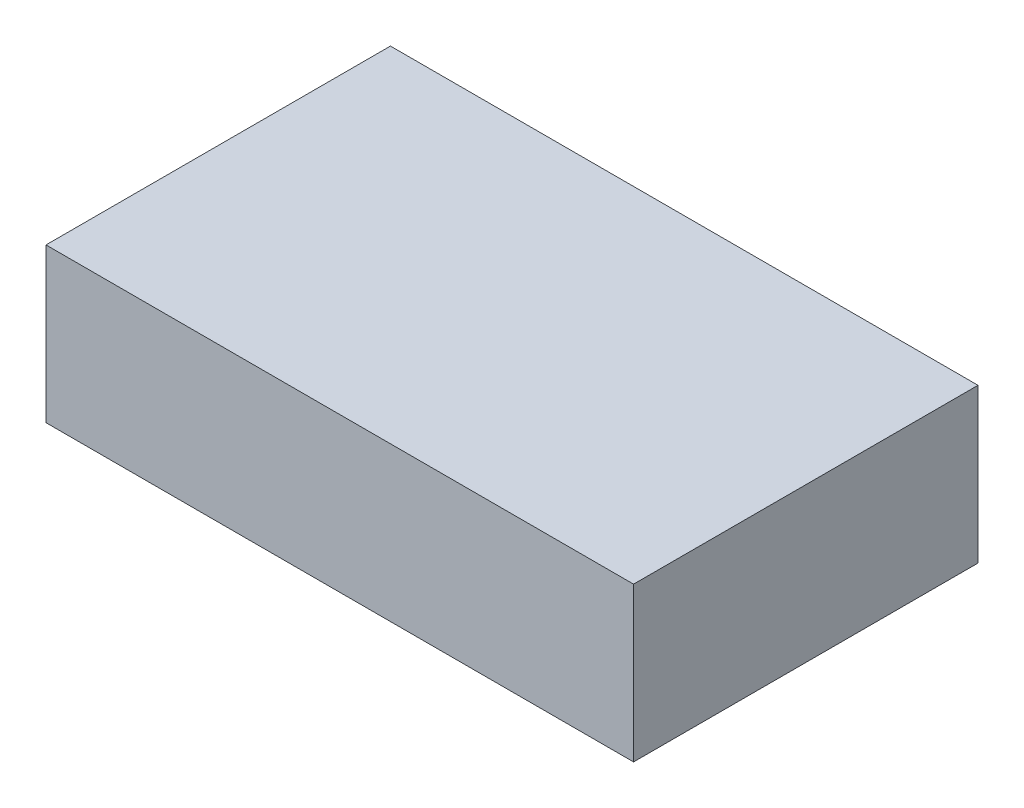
ISO-10303-21;
HEADER;
FILE_DESCRIPTION(('STEP AP214'),'2;1');
FILE_NAME('part.step','',(''),(''),'','','');
FILE_SCHEMA(('AUTOMOTIVE_DESIGN { 1 0 10303 214 1 1 1 1 }'));
ENDSEC;
DATA;
#1=APPLICATION_CONTEXT('core data for automotive mechanical design processes');
#2=APPLICATION_PROTOCOL_DEFINITION('international standard','automotive_design',2000,#1);
#3=PRODUCT_CONTEXT('',#1,'mechanical');
#4=PRODUCT('Part','Part','',(#3));
#5=PRODUCT_RELATED_PRODUCT_CATEGORY('part','',(#4));
#6=PRODUCT_DEFINITION_FORMATION('','',#4);
#7=PRODUCT_DEFINITION_CONTEXT('part definition',#1,'design');
#8=PRODUCT_DEFINITION('design','',#6,#7);
#9=PRODUCT_DEFINITION_SHAPE('','',#8);
#10=(LENGTH_UNIT() NAMED_UNIT(*) SI_UNIT(.MILLI.,.METRE.));
#11=(NAMED_UNIT(*) PLANE_ANGLE_UNIT() SI_UNIT($,.RADIAN.));
#12=(NAMED_UNIT(*) SI_UNIT($,.STERADIAN.) SOLID_ANGLE_UNIT());
#13=UNCERTAINTY_MEASURE_WITH_UNIT(LENGTH_MEASURE(1.E-05),#10,'distance_accuracy_value','');
#14=(GEOMETRIC_REPRESENTATION_CONTEXT(3) GLOBAL_UNCERTAINTY_ASSIGNED_CONTEXT((#13)) GLOBAL_UNIT_ASSIGNED_CONTEXT((#10,
#11,#12)) REPRESENTATION_CONTEXT('',''));
#15=CARTESIAN_POINT('',(0.,0.,0.));
#16=DIRECTION('',(0.,0.,1.));
#17=DIRECTION('',(1.,0.,0.));
#18=AXIS2_PLACEMENT_3D('',#15,#16,#17);
#19=CARTESIAN_POINT('',(67.619013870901,17.8957186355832,30.4091027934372));
#20=DIRECTION('',(0.,0.,1.));
#21=DIRECTION('',(1.,0.,0.));
#22=AXIS2_PLACEMENT_3D('',#19,#20,#21);
#23=PLANE('',#22);
#24=DIRECTION('',(0.,1.,0.));
#25=VECTOR('',#24,1.);
#26=CARTESIAN_POINT('',(69.619013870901,42.8957186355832,30.4091027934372));
#27=LINE('',#26,#25);
#28=CARTESIAN_POINT('',(69.619013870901,24.8957186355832,30.4091027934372));
#29=VERTEX_POINT('',#28);
#30=CARTESIAN_POINT('',(69.619013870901,37.8957186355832,30.4091027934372));
#31=VERTEX_POINT('',#30);
#32=EDGE_CURVE('E457',#29,#31,#27,.T.);
#33=ORIENTED_EDGE('',*,*,#32,.F.);
#34=DIRECTION('',(1.,0.,0.));
#35=VECTOR('',#34,1.);
#36=CARTESIAN_POINT('',(67.619013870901,24.8957186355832,30.4091027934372));
#37=LINE('',#36,#35);
#38=CARTESIAN_POINT('',(72.5,24.8957186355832,30.4091027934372));
#39=VERTEX_POINT('',#38);
#40=EDGE_CURVE('E590',#29,#39,#37,.T.);
#41=ORIENTED_EDGE('',*,*,#40,.T.);
#42=DIRECTION('',(0.,1.,0.));
#43=VECTOR('',#42,1.);
#44=CARTESIAN_POINT('',(72.5,38.,30.4091027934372));
#45=LINE('',#44,#43);
#46=CARTESIAN_POINT('',(72.5,37.8957186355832,30.4091027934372));
#47=VERTEX_POINT('',#46);
#48=EDGE_CURVE('E305',#39,#47,#45,.T.);
#49=ORIENTED_EDGE('',*,*,#48,.T.);
#50=DIRECTION('',(-1.,0.,0.));
#51=VECTOR('',#50,1.);
#52=CARTESIAN_POINT('',(67.619013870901,37.8957186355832,30.4091027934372));
#53=LINE('',#52,#51);
#54=EDGE_CURVE('E414',#47,#31,#53,.T.);
#55=ORIENTED_EDGE('',*,*,#54,.T.);
#56=EDGE_LOOP('',(#33,#41,#49,#55));
#57=FACE_BOUND('',#56,.T.);
#58=ADVANCED_FACE('F43',(#57),#23,.T.);
#59=CARTESIAN_POINT('',(72.619013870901,17.8957186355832,-29.5908972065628));
#60=DIRECTION('',(0.,0.,-1.));
#61=DIRECTION('',(-1.,0.,0.));
#62=AXIS2_PLACEMENT_3D('',#59,#60,#61);
#63=PLANE('',#62);
#64=DIRECTION('',(0.,-1.,0.));
#65=VECTOR('',#64,1.);
#66=CARTESIAN_POINT('',(72.5,38.,-29.5908972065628));
#67=LINE('',#66,#65);
#68=CARTESIAN_POINT('',(72.5,37.8957186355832,-29.5908972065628));
#69=VERTEX_POINT('',#68);
#70=CARTESIAN_POINT('',(72.5,24.8957186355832,-29.5908972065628));
#71=VERTEX_POINT('',#70);
#72=EDGE_CURVE('E302',#69,#71,#67,.T.);
#73=ORIENTED_EDGE('',*,*,#72,.T.);
#74=DIRECTION('',(-1.,0.,0.));
#75=VECTOR('',#74,1.);
#76=CARTESIAN_POINT('',(72.619013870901,24.8957186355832,-29.5908972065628));
#77=LINE('',#76,#75);
#78=CARTESIAN_POINT('',(69.619013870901,24.8957186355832,-29.5908972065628));
#79=VERTEX_POINT('',#78);
#80=EDGE_CURVE('E285',#71,#79,#77,.T.);
#81=ORIENTED_EDGE('',*,*,#80,.T.);
#82=DIRECTION('',(0.,1.,0.));
#83=VECTOR('',#82,1.);
#84=CARTESIAN_POINT('',(69.619013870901,17.8957186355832,-29.5908972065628));
#85=LINE('',#84,#83);
#86=CARTESIAN_POINT('',(69.619013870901,37.8957186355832,-29.5908972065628));
#87=VERTEX_POINT('',#86);
#88=EDGE_CURVE('E464',#87,#79,#85,.F.);
#89=ORIENTED_EDGE('',*,*,#88,.F.);
#90=DIRECTION('',(1.,0.,0.));
#91=VECTOR('',#90,1.);
#92=CARTESIAN_POINT('',(72.619013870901,37.8957186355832,-29.5908972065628));
#93=LINE('',#92,#91);
#94=EDGE_CURVE('E310',#87,#69,#93,.T.);
#95=ORIENTED_EDGE('',*,*,#94,.T.);
#96=EDGE_LOOP('',(#73,#81,#89,#95));
#97=FACE_BOUND('',#96,.T.);
#98=ADVANCED_FACE('F308',(#97),#63,.T.);
#99=CARTESIAN_POINT('',(67.619013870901,17.8957186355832,30.4091027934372));
#100=DIRECTION('',(-1.,0.,0.));
#101=DIRECTION('',(0.,0.,1.));
#102=AXIS2_PLACEMENT_3D('',#99,#100,#101);
#103=PLANE('',#102);
#104=DIRECTION('',(0.,1.,0.));
#105=VECTOR('',#104,1.);
#106=CARTESIAN_POINT('',(67.619013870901,17.8957186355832,22.4091027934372));
#107=LINE('',#106,#105);
#108=CARTESIAN_POINT('',(67.619013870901,24.8957186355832,22.4091027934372));
#109=VERTEX_POINT('',#108);
#110=CARTESIAN_POINT('',(67.619013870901,37.8957186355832,22.4091027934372));
#111=VERTEX_POINT('',#110);
#112=EDGE_CURVE('E452',#109,#111,#107,.T.);
#113=ORIENTED_EDGE('',*,*,#112,.F.);
#114=DIRECTION('',(0.,0.,1.));
#115=VECTOR('',#114,1.);
#116=CARTESIAN_POINT('',(67.619013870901,24.8957186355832,30.4091027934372));
#117=LINE('',#116,#115);
#118=CARTESIAN_POINT('',(67.619013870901,24.8957186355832,28.4091027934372));
#119=VERTEX_POINT('',#118);
#120=EDGE_CURVE('E596',#109,#119,#117,.T.);
#121=ORIENTED_EDGE('',*,*,#120,.T.);
#122=DIRECTION('',(0.,1.,0.));
#123=VECTOR('',#122,1.);
#124=CARTESIAN_POINT('',(67.619013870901,17.8957186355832,28.4091027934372));
#125=LINE('',#124,#123);
#126=CARTESIAN_POINT('',(67.619013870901,37.8957186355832,28.4091027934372));
#127=VERTEX_POINT('',#126);
#128=EDGE_CURVE('E459',#127,#119,#125,.F.);
#129=ORIENTED_EDGE('',*,*,#128,.F.);
#130=DIRECTION('',(0.,0.,-1.));
#131=VECTOR('',#130,1.);
#132=CARTESIAN_POINT('',(67.619013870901,37.8957186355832,30.4091027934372));
#133=LINE('',#132,#131);
#134=EDGE_CURVE('E409',#127,#111,#133,.T.);
#135=ORIENTED_EDGE('',*,*,#134,.T.);
#136=EDGE_LOOP('',(#113,#121,#129,#135));
#137=FACE_BOUND('',#136,.T.);
#138=ADVANCED_FACE('F628',(#137),#103,.T.);
#139=CARTESIAN_POINT('',(67.619013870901,17.8957186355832,20.4091027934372));
#140=DIRECTION('',(0.,0.,1.));
#141=DIRECTION('',(1.,0.,0.));
#142=AXIS2_PLACEMENT_3D('',#139,#140,#141);
#143=PLANE('',#142);
#144=DIRECTION('',(0.,1.,0.));
#145=VECTOR('',#144,1.);
#146=CARTESIAN_POINT('',(61.619013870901,17.8957186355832,20.4091027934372));
#147=LINE('',#146,#145);
#148=CARTESIAN_POINT('',(61.619013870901,24.8957186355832,20.4091027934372));
#149=VERTEX_POINT('',#148);
#150=CARTESIAN_POINT('',(61.619013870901,37.8957186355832,20.4091027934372));
#151=VERTEX_POINT('',#150);
#152=EDGE_CURVE('E437',#149,#151,#147,.T.);
#153=ORIENTED_EDGE('',*,*,#152,.F.);
#154=DIRECTION('',(1.,0.,0.));
#155=VECTOR('',#154,1.);
#156=CARTESIAN_POINT('',(67.619013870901,24.8957186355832,20.4091027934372));
#157=LINE('',#156,#155);
#158=CARTESIAN_POINT('',(65.619013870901,24.8957186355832,20.4091027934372));
#159=VERTEX_POINT('',#158);
#160=EDGE_CURVE('E1123',#149,#159,#157,.T.);
#161=ORIENTED_EDGE('',*,*,#160,.T.);
#162=DIRECTION('',(0.,1.,0.));
#163=VECTOR('',#162,1.);
#164=CARTESIAN_POINT('',(65.619013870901,17.8957186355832,20.4091027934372));
#165=LINE('',#164,#163);
#166=CARTESIAN_POINT('',(65.619013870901,37.8957186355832,20.4091027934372));
#167=VERTEX_POINT('',#166);
#168=EDGE_CURVE('E454',#167,#159,#165,.F.);
#169=ORIENTED_EDGE('',*,*,#168,.F.);
#170=DIRECTION('',(-1.,0.,0.));
#171=VECTOR('',#170,1.);
#172=CARTESIAN_POINT('',(67.619013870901,37.8957186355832,20.4091027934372));
#173=LINE('',#172,#171);
#174=EDGE_CURVE('E403',#167,#151,#173,.T.);
#175=ORIENTED_EDGE('',*,*,#174,.T.);
#176=EDGE_LOOP('',(#153,#161,#169,#175));
#177=FACE_BOUND('',#176,.T.);
#178=ADVANCED_FACE('F635',(#177),#143,.T.);
#179=CARTESIAN_POINT('',(59.619013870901,17.8957186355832,20.4091027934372));
#180=DIRECTION('',(1.,0.,0.));
#181=DIRECTION('',(0.,0.,-1.));
#182=AXIS2_PLACEMENT_3D('',#179,#180,#181);
#183=PLANE('',#182);
#184=DIRECTION('',(0.,1.,0.));
#185=VECTOR('',#184,1.);
#186=CARTESIAN_POINT('',(59.619013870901,42.8957186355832,25.4091027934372));
#187=LINE('',#186,#185);
#188=CARTESIAN_POINT('',(59.619013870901,24.8957186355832,25.4091027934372));
#189=VERTEX_POINT('',#188);
#190=CARTESIAN_POINT('',(59.619013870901,37.8957186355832,25.4091027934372));
#191=VERTEX_POINT('',#190);
#192=EDGE_CURVE('E432',#189,#191,#187,.T.);
#193=ORIENTED_EDGE('',*,*,#192,.F.);
#194=DIRECTION('',(0.,0.,-1.));
#195=VECTOR('',#194,1.);
#196=CARTESIAN_POINT('',(59.619013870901,24.8957186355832,20.4091027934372));
#197=LINE('',#196,#195);
#198=CARTESIAN_POINT('',(59.619013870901,24.8957186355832,22.4091027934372));
#199=VERTEX_POINT('',#198);
#200=EDGE_CURVE('E1130',#189,#199,#197,.T.);
#201=ORIENTED_EDGE('',*,*,#200,.T.);
#202=DIRECTION('',(0.,1.,0.));
#203=VECTOR('',#202,1.);
#204=CARTESIAN_POINT('',(59.619013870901,17.8957186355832,22.4091027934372));
#205=LINE('',#204,#203);
#206=CARTESIAN_POINT('',(59.619013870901,37.8957186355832,22.4091027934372));
#207=VERTEX_POINT('',#206);
#208=EDGE_CURVE('E439',#207,#199,#205,.F.);
#209=ORIENTED_EDGE('',*,*,#208,.F.);
#210=DIRECTION('',(0.,0.,1.));
#211=VECTOR('',#210,1.);
#212=CARTESIAN_POINT('',(59.619013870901,37.8957186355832,20.4091027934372));
#213=LINE('',#212,#211);
#214=EDGE_CURVE('E397',#207,#191,#213,.T.);
#215=ORIENTED_EDGE('',*,*,#214,.T.);
#216=EDGE_LOOP('',(#193,#201,#209,#215));
#217=FACE_BOUND('',#216,.T.);
#218=ADVANCED_FACE('F639',(#217),#183,.T.);
#219=CARTESIAN_POINT('',(59.619013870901,17.8957186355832,30.4091027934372));
#220=DIRECTION('',(0.,0.,1.));
#221=DIRECTION('',(1.,0.,0.));
#222=AXIS2_PLACEMENT_3D('',#219,#220,#221);
#223=PLANE('',#222);
#224=DIRECTION('',(0.,1.,0.));
#225=VECTOR('',#224,1.);
#226=CARTESIAN_POINT('',(-25.3809861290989,42.8957186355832,30.4091027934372));
#227=LINE('',#226,#225);
#228=CARTESIAN_POINT('',(-25.3809861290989,24.8957186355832,30.4091027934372));
#229=VERTEX_POINT('',#228);
#230=CARTESIAN_POINT('',(-25.3809861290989,37.8957186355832,30.4091027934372));
#231=VERTEX_POINT('',#230);
#232=EDGE_CURVE('E422',#229,#231,#227,.T.);
#233=ORIENTED_EDGE('',*,*,#232,.F.);
#234=DIRECTION('',(1.,0.,0.));
#235=VECTOR('',#234,1.);
#236=CARTESIAN_POINT('',(59.619013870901,24.8957186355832,30.4091027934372));
#237=LINE('',#236,#235);
#238=CARTESIAN_POINT('',(54.619013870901,24.8957186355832,30.4091027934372));
#239=VERTEX_POINT('',#238);
#240=EDGE_CURVE('E1136',#229,#239,#237,.T.);
#241=ORIENTED_EDGE('',*,*,#240,.T.);
#242=DIRECTION('',(0.,1.,0.));
#243=VECTOR('',#242,1.);
#244=CARTESIAN_POINT('',(54.619013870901,17.8957186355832,30.4091027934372));
#245=LINE('',#244,#243);
#246=CARTESIAN_POINT('',(54.619013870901,37.8957186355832,30.4091027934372));
#247=VERTEX_POINT('',#246);
#248=EDGE_CURVE('E434',#247,#239,#245,.F.);
#249=ORIENTED_EDGE('',*,*,#248,.F.);
#250=DIRECTION('',(-1.,0.,0.));
#251=VECTOR('',#250,1.);
#252=CARTESIAN_POINT('',(59.619013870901,37.8957186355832,30.4091027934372));
#253=LINE('',#252,#251);
#254=EDGE_CURVE('E392',#247,#231,#253,.T.);
#255=ORIENTED_EDGE('',*,*,#254,.T.);
#256=EDGE_LOOP('',(#233,#241,#249,#255));
#257=FACE_BOUND('',#256,.T.);
#258=ADVANCED_FACE('F643',(#257),#223,.T.);
#259=CARTESIAN_POINT('',(-30.380986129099,17.8957186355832,30.4091027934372));
#260=DIRECTION('',(-1.,0.,0.));
#261=DIRECTION('',(0.,0.,1.));
#262=AXIS2_PLACEMENT_3D('',#259,#260,#261);
#263=PLANE('',#262);
#264=DIRECTION('',(0.,1.,0.));
#265=VECTOR('',#264,1.);
#266=CARTESIAN_POINT('',(-30.380986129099,42.8957186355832,-24.5908972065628));
#267=LINE('',#266,#265);
#268=CARTESIAN_POINT('',(-30.380986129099,24.8957186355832,-24.5908972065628));
#269=VERTEX_POINT('',#268);
#270=CARTESIAN_POINT('',(-30.380986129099,37.8957186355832,-24.5908972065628));
#271=VERTEX_POINT('',#270);
#272=EDGE_CURVE('E417',#269,#271,#267,.T.);
#273=ORIENTED_EDGE('',*,*,#272,.F.);
#274=DIRECTION('',(0.,0.,1.));
#275=VECTOR('',#274,1.);
#276=CARTESIAN_POINT('',(-30.380986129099,24.8957186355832,30.4091027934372));
#277=LINE('',#276,#275);
#278=CARTESIAN_POINT('',(-30.380986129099,24.8957186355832,25.4091027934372));
#279=VERTEX_POINT('',#278);
#280=EDGE_CURVE('E1142',#269,#279,#277,.T.);
#281=ORIENTED_EDGE('',*,*,#280,.T.);
#282=DIRECTION('',(0.,1.,0.));
#283=VECTOR('',#282,1.);
#284=CARTESIAN_POINT('',(-30.380986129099,17.8957186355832,25.4091027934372));
#285=LINE('',#284,#283);
#286=CARTESIAN_POINT('',(-30.380986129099,37.8957186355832,25.4091027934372));
#287=VERTEX_POINT('',#286);
#288=EDGE_CURVE('E424',#287,#279,#285,.F.);
#289=ORIENTED_EDGE('',*,*,#288,.F.);
#290=DIRECTION('',(0.,0.,-1.));
#291=VECTOR('',#290,1.);
#292=CARTESIAN_POINT('',(-30.380986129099,37.8957186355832,30.4091027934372));
#293=LINE('',#292,#291);
#294=EDGE_CURVE('E387',#287,#271,#293,.T.);
#295=ORIENTED_EDGE('',*,*,#294,.T.);
#296=EDGE_LOOP('',(#273,#281,#289,#295));
#297=FACE_BOUND('',#296,.T.);
#298=ADVANCED_FACE('F647',(#297),#263,.T.);
#299=CARTESIAN_POINT('',(59.619013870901,17.8957186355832,-29.5908972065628));
#300=DIRECTION('',(0.,0.,-1.));
#301=DIRECTION('',(-1.,0.,0.));
#302=AXIS2_PLACEMENT_3D('',#299,#300,#301);
#303=PLANE('',#302);
#304=DIRECTION('',(0.,1.,0.));
#305=VECTOR('',#304,1.);
#306=CARTESIAN_POINT('',(54.619013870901,42.8957186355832,-29.5908972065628));
#307=LINE('',#306,#305);
#308=CARTESIAN_POINT('',(54.619013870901,24.8957186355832,-29.5908972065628));
#309=VERTEX_POINT('',#308);
#310=CARTESIAN_POINT('',(54.619013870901,37.8957186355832,-29.5908972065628));
#311=VERTEX_POINT('',#310);
#312=EDGE_CURVE('E427',#309,#311,#307,.T.);
#313=ORIENTED_EDGE('',*,*,#312,.F.);
#314=DIRECTION('',(-1.,0.,0.));
#315=VECTOR('',#314,1.);
#316=CARTESIAN_POINT('',(59.619013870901,24.8957186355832,-29.5908972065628));
#317=LINE('',#316,#315);
#318=CARTESIAN_POINT('',(-25.3809861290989,24.8957186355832,-29.5908972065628));
#319=VERTEX_POINT('',#318);
#320=EDGE_CURVE('E1148',#309,#319,#317,.T.);
#321=ORIENTED_EDGE('',*,*,#320,.T.);
#322=DIRECTION('',(0.,1.,0.));
#323=VECTOR('',#322,1.);
#324=CARTESIAN_POINT('',(-25.3809861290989,17.8957186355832,-29.5908972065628));
#325=LINE('',#324,#323);
#326=CARTESIAN_POINT('',(-25.3809861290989,37.8957186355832,-29.5908972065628));
#327=VERTEX_POINT('',#326);
#328=EDGE_CURVE('E419',#327,#319,#325,.F.);
#329=ORIENTED_EDGE('',*,*,#328,.F.);
#330=DIRECTION('',(1.,0.,0.));
#331=VECTOR('',#330,1.);
#332=CARTESIAN_POINT('',(59.619013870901,37.8957186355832,-29.5908972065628));
#333=LINE('',#332,#331);
#334=EDGE_CURVE('E382',#327,#311,#333,.T.);
#335=ORIENTED_EDGE('',*,*,#334,.T.);
#336=EDGE_LOOP('',(#313,#321,#329,#335));
#337=FACE_BOUND('',#336,.T.);
#338=ADVANCED_FACE('F651',(#337),#303,.T.);
#339=CARTESIAN_POINT('',(59.619013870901,17.8957186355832,-19.5908972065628));
#340=DIRECTION('',(1.,0.,0.));
#341=DIRECTION('',(0.,0.,-1.));
#342=AXIS2_PLACEMENT_3D('',#339,#340,#341);
#343=PLANE('',#342);
#344=DIRECTION('',(0.,1.,0.));
#345=VECTOR('',#344,1.);
#346=CARTESIAN_POINT('',(59.619013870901,17.8957186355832,-21.5908972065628));
#347=LINE('',#346,#345);
#348=CARTESIAN_POINT('',(59.619013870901,24.8957186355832,-21.5908972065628));
#349=VERTEX_POINT('',#348);
#350=CARTESIAN_POINT('',(59.619013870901,37.8957186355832,-21.5908972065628));
#351=VERTEX_POINT('',#350);
#352=EDGE_CURVE('E442',#349,#351,#347,.T.);
#353=ORIENTED_EDGE('',*,*,#352,.F.);
#354=DIRECTION('',(0.,0.,-1.));
#355=VECTOR('',#354,1.);
#356=CARTESIAN_POINT('',(59.619013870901,24.8957186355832,-19.5908972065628));
#357=LINE('',#356,#355);
#358=CARTESIAN_POINT('',(59.619013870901,24.8957186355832,-24.5908972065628));
#359=VERTEX_POINT('',#358);
#360=EDGE_CURVE('E1154',#349,#359,#357,.T.);
#361=ORIENTED_EDGE('',*,*,#360,.T.);
#362=DIRECTION('',(0.,1.,0.));
#363=VECTOR('',#362,1.);
#364=CARTESIAN_POINT('',(59.619013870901,17.8957186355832,-24.5908972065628));
#365=LINE('',#364,#363);
#366=CARTESIAN_POINT('',(59.619013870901,37.8957186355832,-24.5908972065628));
#367=VERTEX_POINT('',#366);
#368=EDGE_CURVE('E429',#367,#359,#365,.F.);
#369=ORIENTED_EDGE('',*,*,#368,.F.);
#370=DIRECTION('',(0.,0.,1.));
#371=VECTOR('',#370,1.);
#372=CARTESIAN_POINT('',(59.619013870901,37.8957186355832,-19.5908972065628));
#373=LINE('',#372,#371);
#374=EDGE_CURVE('E377',#367,#351,#373,.T.);
#375=ORIENTED_EDGE('',*,*,#374,.T.);
#376=EDGE_LOOP('',(#353,#361,#369,#375));
#377=FACE_BOUND('',#376,.T.);
#378=ADVANCED_FACE('F655',(#377),#343,.T.);
#379=CARTESIAN_POINT('',(67.619013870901,17.8957186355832,-19.5908972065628));
#380=DIRECTION('',(0.,0.,-1.));
#381=DIRECTION('',(-1.,0.,0.));
#382=AXIS2_PLACEMENT_3D('',#379,#380,#381);
#383=PLANE('',#382);
#384=DIRECTION('',(0.,1.,0.));
#385=VECTOR('',#384,1.);
#386=CARTESIAN_POINT('',(65.619013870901,17.8957186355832,-19.5908972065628));
#387=LINE('',#386,#385);
#388=CARTESIAN_POINT('',(65.619013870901,24.8957186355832,-19.5908972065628));
#389=VERTEX_POINT('',#388);
#390=CARTESIAN_POINT('',(65.619013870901,37.8957186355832,-19.5908972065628));
#391=VERTEX_POINT('',#390);
#392=EDGE_CURVE('E447',#389,#391,#387,.T.);
#393=ORIENTED_EDGE('',*,*,#392,.F.);
#394=DIRECTION('',(-1.,0.,0.));
#395=VECTOR('',#394,1.);
#396=CARTESIAN_POINT('',(67.619013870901,24.8957186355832,-19.5908972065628));
#397=LINE('',#396,#395);
#398=CARTESIAN_POINT('',(61.619013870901,24.8957186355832,-19.5908972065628));
#399=VERTEX_POINT('',#398);
#400=EDGE_CURVE('E1159',#389,#399,#397,.T.);
#401=ORIENTED_EDGE('',*,*,#400,.T.);
#402=DIRECTION('',(0.,1.,0.));
#403=VECTOR('',#402,1.);
#404=CARTESIAN_POINT('',(61.619013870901,17.8957186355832,-19.5908972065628));
#405=LINE('',#404,#403);
#406=CARTESIAN_POINT('',(61.619013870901,37.8957186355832,-19.5908972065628));
#407=VERTEX_POINT('',#406);
#408=EDGE_CURVE('E444',#407,#399,#405,.F.);
#409=ORIENTED_EDGE('',*,*,#408,.F.);
#410=DIRECTION('',(1.,0.,0.));
#411=VECTOR('',#410,1.);
#412=CARTESIAN_POINT('',(67.619013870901,37.8957186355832,-19.5908972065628));
#413=LINE('',#412,#411);
#414=EDGE_CURVE('E371',#407,#391,#413,.T.);
#415=ORIENTED_EDGE('',*,*,#414,.T.);
#416=EDGE_LOOP('',(#393,#401,#409,#415));
#417=FACE_BOUND('',#416,.T.);
#418=ADVANCED_FACE('F659',(#417),#383,.T.);
#419=CARTESIAN_POINT('',(67.619013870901,17.8957186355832,-29.5908972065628));
#420=DIRECTION('',(-1.,0.,0.));
#421=DIRECTION('',(0.,0.,1.));
#422=AXIS2_PLACEMENT_3D('',#419,#420,#421);
#423=PLANE('',#422);
#424=DIRECTION('',(0.,1.,0.));
#425=VECTOR('',#424,1.);
#426=CARTESIAN_POINT('',(67.619013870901,42.8957186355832,-27.5908972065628));
#427=LINE('',#426,#425);
#428=CARTESIAN_POINT('',(67.619013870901,24.8957186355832,-27.5908972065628));
#429=VERTEX_POINT('',#428);
#430=CARTESIAN_POINT('',(67.619013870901,37.8957186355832,-27.5908972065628));
#431=VERTEX_POINT('',#430);
#432=EDGE_CURVE('E462',#429,#431,#427,.T.);
#433=ORIENTED_EDGE('',*,*,#432,.F.);
#434=DIRECTION('',(0.,0.,1.));
#435=VECTOR('',#434,1.);
#436=CARTESIAN_POINT('',(67.619013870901,24.8957186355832,-29.5908972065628));
#437=LINE('',#436,#435);
#438=CARTESIAN_POINT('',(67.619013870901,24.8957186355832,-21.5908972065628));
#439=VERTEX_POINT('',#438);
#440=EDGE_CURVE('E58',#429,#439,#437,.T.);
#441=ORIENTED_EDGE('',*,*,#440,.T.);
#442=DIRECTION('',(0.,1.,0.));
#443=VECTOR('',#442,1.);
#444=CARTESIAN_POINT('',(67.619013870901,17.8957186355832,-21.5908972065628));
#445=LINE('',#444,#443);
#446=CARTESIAN_POINT('',(67.619013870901,37.8957186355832,-21.5908972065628));
#447=VERTEX_POINT('',#446);
#448=EDGE_CURVE('E449',#447,#439,#445,.F.);
#449=ORIENTED_EDGE('',*,*,#448,.F.);
#450=DIRECTION('',(0.,0.,-1.));
#451=VECTOR('',#450,1.);
#452=CARTESIAN_POINT('',(67.619013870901,37.8957186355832,-29.5908972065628));
#453=LINE('',#452,#451);
#454=EDGE_CURVE('E365',#447,#431,#453,.T.);
#455=ORIENTED_EDGE('',*,*,#454,.T.);
#456=EDGE_LOOP('',(#433,#441,#449,#455));
#457=FACE_BOUND('',#456,.T.);
#458=ADVANCED_FACE('F663',(#457),#423,.T.);
#459=CARTESIAN_POINT('',(-25.3809861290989,17.8957186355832,-24.5908972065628));
#460=DIRECTION('',(0.,-1.,0.));
#461=DIRECTION('',(0.,0.,-1.));
#462=AXIS2_PLACEMENT_3D('',#459,#460,#461);
#463=CYLINDRICAL_SURFACE('',#462,5.);
#464=ORIENTED_EDGE('',*,*,#328,.T.);
#465=CARTESIAN_POINT('',(-25.3809861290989,24.8957186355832,-24.5908972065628));
#466=DIRECTION('',(0.,-1.,0.));
#467=DIRECTION('',(0.,0.,-1.));
#468=AXIS2_PLACEMENT_3D('',#465,#466,#467);
#469=CIRCLE('',#468,5.);
#470=EDGE_CURVE('E1145',#319,#269,#469,.F.);
#471=ORIENTED_EDGE('',*,*,#470,.T.);
#472=ORIENTED_EDGE('',*,*,#272,.T.);
#473=CARTESIAN_POINT('',(-25.3809861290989,37.8957186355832,-24.5908972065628));
#474=DIRECTION('',(0.,1.,0.));
#475=DIRECTION('',(0.,0.,1.));
#476=AXIS2_PLACEMENT_3D('',#473,#474,#475);
#477=CIRCLE('',#476,5.);
#478=EDGE_CURVE('E385',#271,#327,#477,.F.);
#479=ORIENTED_EDGE('',*,*,#478,.T.);
#480=EDGE_LOOP('',(#464,#471,#472,#479));
#481=FACE_BOUND('',#480,.T.);
#482=ADVANCED_FACE('F666',(#481),#463,.T.);
#483=CARTESIAN_POINT('',(-25.3809861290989,17.8957186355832,25.4091027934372));
#484=DIRECTION('',(0.,-1.,0.));
#485=DIRECTION('',(0.,0.,-1.));
#486=AXIS2_PLACEMENT_3D('',#483,#484,#485);
#487=CYLINDRICAL_SURFACE('',#486,5.);
#488=ORIENTED_EDGE('',*,*,#288,.T.);
#489=CARTESIAN_POINT('',(-25.3809861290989,24.8957186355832,25.4091027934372));
#490=DIRECTION('',(0.,-1.,0.));
#491=DIRECTION('',(0.,0.,-1.));
#492=AXIS2_PLACEMENT_3D('',#489,#490,#491);
#493=CIRCLE('',#492,5.);
#494=EDGE_CURVE('E1139',#279,#229,#493,.F.);
#495=ORIENTED_EDGE('',*,*,#494,.T.);
#496=ORIENTED_EDGE('',*,*,#232,.T.);
#497=CARTESIAN_POINT('',(-25.3809861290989,37.8957186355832,25.4091027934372));
#498=DIRECTION('',(0.,1.,0.));
#499=DIRECTION('',(0.,0.,1.));
#500=AXIS2_PLACEMENT_3D('',#497,#498,#499);
#501=CIRCLE('',#500,5.);
#502=EDGE_CURVE('E390',#231,#287,#501,.F.);
#503=ORIENTED_EDGE('',*,*,#502,.T.);
#504=EDGE_LOOP('',(#488,#495,#496,#503));
#505=FACE_BOUND('',#504,.T.);
#506=ADVANCED_FACE('F671',(#505),#487,.T.);
#507=CARTESIAN_POINT('',(54.619013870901,17.8957186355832,-24.5908972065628));
#508=DIRECTION('',(0.,-1.,0.));
#509=DIRECTION('',(0.,0.,-1.));
#510=AXIS2_PLACEMENT_3D('',#507,#508,#509);
#511=CYLINDRICAL_SURFACE('',#510,5.);
#512=ORIENTED_EDGE('',*,*,#368,.T.);
#513=CARTESIAN_POINT('',(54.619013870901,24.8957186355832,-24.5908972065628));
#514=DIRECTION('',(0.,-1.,0.));
#515=DIRECTION('',(0.,0.,-1.));
#516=AXIS2_PLACEMENT_3D('',#513,#514,#515);
#517=CIRCLE('',#516,5.);
#518=EDGE_CURVE('E1151',#359,#309,#517,.F.);
#519=ORIENTED_EDGE('',*,*,#518,.T.);
#520=ORIENTED_EDGE('',*,*,#312,.T.);
#521=CARTESIAN_POINT('',(54.619013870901,37.8957186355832,-24.5908972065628));
#522=DIRECTION('',(0.,1.,0.));
#523=DIRECTION('',(0.,0.,1.));
#524=AXIS2_PLACEMENT_3D('',#521,#522,#523);
#525=CIRCLE('',#524,5.);
#526=EDGE_CURVE('E380',#311,#367,#525,.F.);
#527=ORIENTED_EDGE('',*,*,#526,.T.);
#528=EDGE_LOOP('',(#512,#519,#520,#527));
#529=FACE_BOUND('',#528,.T.);
#530=ADVANCED_FACE('F675',(#529),#511,.T.);
#531=CARTESIAN_POINT('',(54.619013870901,17.8957186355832,25.4091027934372));
#532=DIRECTION('',(0.,-1.,0.));
#533=DIRECTION('',(0.,0.,-1.));
#534=AXIS2_PLACEMENT_3D('',#531,#532,#533);
#535=CYLINDRICAL_SURFACE('',#534,5.);
#536=ORIENTED_EDGE('',*,*,#248,.T.);
#537=CARTESIAN_POINT('',(54.619013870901,24.8957186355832,25.4091027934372));
#538=DIRECTION('',(0.,-1.,0.));
#539=DIRECTION('',(0.,0.,-1.));
#540=AXIS2_PLACEMENT_3D('',#537,#538,#539);
#541=CIRCLE('',#540,5.);
#542=EDGE_CURVE('E1133',#239,#189,#541,.F.);
#543=ORIENTED_EDGE('',*,*,#542,.T.);
#544=ORIENTED_EDGE('',*,*,#192,.T.);
#545=CARTESIAN_POINT('',(54.619013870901,37.8957186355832,25.4091027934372));
#546=DIRECTION('',(0.,1.,0.));
#547=DIRECTION('',(0.,0.,1.));
#548=AXIS2_PLACEMENT_3D('',#545,#546,#547);
#549=CIRCLE('',#548,5.);
#550=EDGE_CURVE('E395',#191,#247,#549,.F.);
#551=ORIENTED_EDGE('',*,*,#550,.T.);
#552=EDGE_LOOP('',(#536,#543,#544,#551));
#553=FACE_BOUND('',#552,.T.);
#554=ADVANCED_FACE('F679',(#553),#535,.T.);
#555=CARTESIAN_POINT('',(61.619013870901,17.8957186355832,22.4091027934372));
#556=DIRECTION('',(0.,1.,0.));
#557=DIRECTION('',(0.,0.,1.));
#558=AXIS2_PLACEMENT_3D('',#555,#556,#557);
#559=CYLINDRICAL_SURFACE('',#558,2.);
#560=CARTESIAN_POINT('',(61.619013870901,24.8957186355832,22.4091027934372));
#561=DIRECTION('',(0.,-1.,0.));
#562=DIRECTION('',(0.,0.,-1.));
#563=AXIS2_PLACEMENT_3D('',#560,#561,#562);
#564=CIRCLE('',#563,2.);
#565=EDGE_CURVE('E1128',#149,#199,#564,.F.);
#566=ORIENTED_EDGE('',*,*,#565,.F.);
#567=ORIENTED_EDGE('',*,*,#152,.T.);
#568=CARTESIAN_POINT('',(61.619013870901,37.8957186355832,22.4091027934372));
#569=DIRECTION('',(0.,1.,0.));
#570=DIRECTION('',(0.,0.,1.));
#571=AXIS2_PLACEMENT_3D('',#568,#569,#570);
#572=CIRCLE('',#571,2.);
#573=EDGE_CURVE('E400',#207,#151,#572,.F.);
#574=ORIENTED_EDGE('',*,*,#573,.F.);
#575=ORIENTED_EDGE('',*,*,#208,.T.);
#576=EDGE_LOOP('',(#566,#567,#574,#575));
#577=FACE_BOUND('',#576,.T.);
#578=ADVANCED_FACE('F683',(#577),#559,.F.);
#579=CARTESIAN_POINT('',(61.619013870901,17.8957186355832,-21.5908972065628));
#580=DIRECTION('',(0.,1.,0.));
#581=DIRECTION('',(0.,0.,1.));
#582=AXIS2_PLACEMENT_3D('',#579,#580,#581);
#583=CYLINDRICAL_SURFACE('',#582,2.);
#584=CARTESIAN_POINT('',(61.619013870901,24.8957186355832,-21.5908972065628));
#585=DIRECTION('',(0.,-1.,0.));
#586=DIRECTION('',(0.,0.,-1.));
#587=AXIS2_PLACEMENT_3D('',#584,#585,#586);
#588=CIRCLE('',#587,2.);
#589=EDGE_CURVE('E1157',#349,#399,#588,.F.);
#590=ORIENTED_EDGE('',*,*,#589,.F.);
#591=ORIENTED_EDGE('',*,*,#352,.T.);
#592=CARTESIAN_POINT('',(61.619013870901,37.8957186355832,-21.5908972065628));
#593=DIRECTION('',(0.,1.,0.));
#594=DIRECTION('',(0.,0.,1.));
#595=AXIS2_PLACEMENT_3D('',#592,#593,#594);
#596=CIRCLE('',#595,2.);
#597=EDGE_CURVE('E374',#407,#351,#596,.F.);
#598=ORIENTED_EDGE('',*,*,#597,.F.);
#599=ORIENTED_EDGE('',*,*,#408,.T.);
#600=EDGE_LOOP('',(#590,#591,#598,#599));
#601=FACE_BOUND('',#600,.T.);
#602=ADVANCED_FACE('F687',(#601),#583,.F.);
#603=CARTESIAN_POINT('',(65.619013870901,17.8957186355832,-21.5908972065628));
#604=DIRECTION('',(0.,1.,0.));
#605=DIRECTION('',(0.,0.,1.));
#606=AXIS2_PLACEMENT_3D('',#603,#604,#605);
#607=CYLINDRICAL_SURFACE('',#606,2.);
#608=CARTESIAN_POINT('',(65.619013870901,24.8957186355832,-21.5908972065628));
#609=DIRECTION('',(0.,-1.,0.));
#610=DIRECTION('',(0.,0.,-1.));
#611=AXIS2_PLACEMENT_3D('',#608,#609,#610);
#612=CIRCLE('',#611,2.);
#613=EDGE_CURVE('E295',#389,#439,#612,.F.);
#614=ORIENTED_EDGE('',*,*,#613,.F.);
#615=ORIENTED_EDGE('',*,*,#392,.T.);
#616=CARTESIAN_POINT('',(65.619013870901,37.8957186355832,-21.5908972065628));
#617=DIRECTION('',(0.,1.,0.));
#618=DIRECTION('',(0.,0.,1.));
#619=AXIS2_PLACEMENT_3D('',#616,#617,#618);
#620=CIRCLE('',#619,2.);
#621=EDGE_CURVE('E368',#447,#391,#620,.F.);
#622=ORIENTED_EDGE('',*,*,#621,.F.);
#623=ORIENTED_EDGE('',*,*,#448,.T.);
#624=EDGE_LOOP('',(#614,#615,#622,#623));
#625=FACE_BOUND('',#624,.T.);
#626=ADVANCED_FACE('F691',(#625),#607,.F.);
#627=CARTESIAN_POINT('',(65.619013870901,17.8957186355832,22.4091027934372));
#628=DIRECTION('',(0.,1.,0.));
#629=DIRECTION('',(0.,0.,1.));
#630=AXIS2_PLACEMENT_3D('',#627,#628,#629);
#631=CYLINDRICAL_SURFACE('',#630,2.);
#632=CARTESIAN_POINT('',(65.619013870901,24.8957186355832,22.4091027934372));
#633=DIRECTION('',(0.,-1.,0.));
#634=DIRECTION('',(0.,0.,-1.));
#635=AXIS2_PLACEMENT_3D('',#632,#633,#634);
#636=CIRCLE('',#635,2.);
#637=EDGE_CURVE('E1122',#109,#159,#636,.F.);
#638=ORIENTED_EDGE('',*,*,#637,.F.);
#639=ORIENTED_EDGE('',*,*,#112,.T.);
#640=CARTESIAN_POINT('',(65.619013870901,37.8957186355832,22.4091027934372));
#641=DIRECTION('',(0.,1.,0.));
#642=DIRECTION('',(0.,0.,1.));
#643=AXIS2_PLACEMENT_3D('',#640,#641,#642);
#644=CIRCLE('',#643,2.);
#645=EDGE_CURVE('E406',#167,#111,#644,.F.);
#646=ORIENTED_EDGE('',*,*,#645,.F.);
#647=ORIENTED_EDGE('',*,*,#168,.T.);
#648=EDGE_LOOP('',(#638,#639,#646,#647));
#649=FACE_BOUND('',#648,.T.);
#650=ADVANCED_FACE('F695',(#649),#631,.F.);
#651=CARTESIAN_POINT('',(69.619013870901,17.8957186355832,28.4091027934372));
#652=DIRECTION('',(0.,-1.,0.));
#653=DIRECTION('',(0.,0.,-1.));
#654=AXIS2_PLACEMENT_3D('',#651,#652,#653);
#655=CYLINDRICAL_SURFACE('',#654,2.);
#656=ORIENTED_EDGE('',*,*,#128,.T.);
#657=CARTESIAN_POINT('',(69.619013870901,24.8957186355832,28.4091027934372));
#658=DIRECTION('',(0.,-1.,0.));
#659=DIRECTION('',(0.,0.,-1.));
#660=AXIS2_PLACEMENT_3D('',#657,#658,#659);
#661=CIRCLE('',#660,2.);
#662=EDGE_CURVE('E591',#119,#29,#661,.F.);
#663=ORIENTED_EDGE('',*,*,#662,.T.);
#664=ORIENTED_EDGE('',*,*,#32,.T.);
#665=CARTESIAN_POINT('',(69.619013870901,37.8957186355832,28.4091027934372));
#666=DIRECTION('',(0.,1.,0.));
#667=DIRECTION('',(0.,0.,1.));
#668=AXIS2_PLACEMENT_3D('',#665,#666,#667);
#669=CIRCLE('',#668,2.);
#670=EDGE_CURVE('E412',#31,#127,#669,.F.);
#671=ORIENTED_EDGE('',*,*,#670,.T.);
#672=EDGE_LOOP('',(#656,#663,#664,#671));
#673=FACE_BOUND('',#672,.T.);
#674=ADVANCED_FACE('F699',(#673),#655,.T.);
#675=CARTESIAN_POINT('',(69.619013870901,17.8957186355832,-27.5908972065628));
#676=DIRECTION('',(0.,-1.,0.));
#677=DIRECTION('',(0.,0.,-1.));
#678=AXIS2_PLACEMENT_3D('',#675,#676,#677);
#679=CYLINDRICAL_SURFACE('',#678,2.);
#680=ORIENTED_EDGE('',*,*,#88,.T.);
#681=CARTESIAN_POINT('',(69.619013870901,24.8957186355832,-27.5908972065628));
#682=DIRECTION('',(0.,-1.,0.));
#683=DIRECTION('',(0.,0.,-1.));
#684=AXIS2_PLACEMENT_3D('',#681,#682,#683);
#685=CIRCLE('',#684,2.);
#686=EDGE_CURVE('E290',#79,#429,#685,.F.);
#687=ORIENTED_EDGE('',*,*,#686,.T.);
#688=ORIENTED_EDGE('',*,*,#432,.T.);
#689=CARTESIAN_POINT('',(69.619013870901,37.8957186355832,-27.5908972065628));
#690=DIRECTION('',(0.,1.,0.));
#691=DIRECTION('',(0.,0.,1.));
#692=AXIS2_PLACEMENT_3D('',#689,#690,#691);
#693=CIRCLE('',#692,2.);
#694=EDGE_CURVE('E315',#431,#87,#693,.F.);
#695=ORIENTED_EDGE('',*,*,#694,.T.);
#696=EDGE_LOOP('',(#680,#687,#688,#695));
#697=FACE_BOUND('',#696,.T.);
#698=ADVANCED_FACE('F467',(#697),#679,.T.);
#699=CARTESIAN_POINT('',(0.119013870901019,37.8957186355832,0.409102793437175));
#700=DIRECTION('',(0.,1.,0.));
#701=DIRECTION('',(0.,0.,1.));
#702=AXIS2_PLACEMENT_3D('',#699,#700,#701);
#703=PLANE('',#702);
#704=DIRECTION('',(0.,0.,1.));
#705=VECTOR('',#704,1.);
#706=CARTESIAN_POINT('',(-39.5,37.8957186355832,-39.5908972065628));
#707=LINE('',#706,#705);
#708=CARTESIAN_POINT('',(-39.5,37.8957186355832,-34.5908972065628));
#709=VERTEX_POINT('',#708);
#710=CARTESIAN_POINT('',(-39.5,37.8957186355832,34.5005934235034));
#711=VERTEX_POINT('',#710);
#712=EDGE_CURVE('E520',#709,#711,#707,.T.);
#713=ORIENTED_EDGE('',*,*,#712,.F.);
#714=DIRECTION('',(1.,0.,0.));
#715=VECTOR('',#714,1.);
#716=CARTESIAN_POINT('',(0.119013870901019,37.8957186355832,-34.5908972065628));
#717=LINE('',#716,#715);
#718=CARTESIAN_POINT('',(72.5,37.8957186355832,-34.5908972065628));
#719=VERTEX_POINT('',#718);
#720=EDGE_CURVE('E474',#709,#719,#717,.T.);
#721=ORIENTED_EDGE('',*,*,#720,.T.);
#722=DIRECTION('',(0.,0.,-1.));
#723=VECTOR('',#722,1.);
#724=CARTESIAN_POINT('',(72.5,37.8957186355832,-42.5));
#725=LINE('',#724,#723);
#726=EDGE_CURVE('E311',#69,#719,#725,.T.);
#727=ORIENTED_EDGE('',*,*,#726,.F.);
#728=ORIENTED_EDGE('',*,*,#94,.F.);
#729=ORIENTED_EDGE('',*,*,#694,.F.);
#730=ORIENTED_EDGE('',*,*,#454,.F.);
#731=ORIENTED_EDGE('',*,*,#621,.T.);
#732=ORIENTED_EDGE('',*,*,#414,.F.);
#733=ORIENTED_EDGE('',*,*,#597,.T.);
#734=ORIENTED_EDGE('',*,*,#374,.F.);
#735=ORIENTED_EDGE('',*,*,#526,.F.);
#736=ORIENTED_EDGE('',*,*,#334,.F.);
#737=ORIENTED_EDGE('',*,*,#478,.F.);
#738=ORIENTED_EDGE('',*,*,#294,.F.);
#739=ORIENTED_EDGE('',*,*,#502,.F.);
#740=ORIENTED_EDGE('',*,*,#254,.F.);
#741=ORIENTED_EDGE('',*,*,#550,.F.);
#742=ORIENTED_EDGE('',*,*,#214,.F.);
#743=ORIENTED_EDGE('',*,*,#573,.T.);
#744=ORIENTED_EDGE('',*,*,#174,.F.);
#745=ORIENTED_EDGE('',*,*,#645,.T.);
#746=ORIENTED_EDGE('',*,*,#134,.F.);
#747=ORIENTED_EDGE('',*,*,#670,.F.);
#748=ORIENTED_EDGE('',*,*,#54,.F.);
#749=CARTESIAN_POINT('',(72.5,37.8957186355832,34.5005934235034));
#750=VERTEX_POINT('',#749);
#751=EDGE_CURVE('E313',#750,#47,#725,.T.);
#752=ORIENTED_EDGE('',*,*,#751,.F.);
#753=DIRECTION('',(-1.,0.,0.));
#754=VECTOR('',#753,1.);
#755=CARTESIAN_POINT('',(0.119013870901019,37.8957186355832,34.5005934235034));
#756=LINE('',#755,#754);
#757=EDGE_CURVE('E512',#750,#711,#756,.T.);
#758=ORIENTED_EDGE('',*,*,#757,.T.);
#759=EDGE_LOOP('',(#713,#721,#727,#728,#729,#730,#731,#732,#733,#734,#735,#736,#737,#738,#739,
#740,#741,#742,#743,#744,#745,#746,#747,#748,#752,#758));
#760=FACE_BOUND('',#759,.T.);
#761=ADVANCED_FACE('F472',(#760),#703,.F.);
#762=CARTESIAN_POINT('',(-72.5,38.,-42.5));
#763=DIRECTION('',(0.,0.,1.));
#764=DIRECTION('',(1.,0.,0.));
#765=AXIS2_PLACEMENT_3D('',#762,#763,#764);
#766=PLANE('',#765);
#767=DIRECTION('',(0.,1.,0.));
#768=VECTOR('',#767,1.);
#769=CARTESIAN_POINT('',(95.5,-19.,-42.5));
#770=LINE('',#769,#768);
#771=CARTESIAN_POINT('',(95.5,15.,-42.5));
#772=VERTEX_POINT('',#771);
#773=CARTESIAN_POINT('',(95.5,53.,-42.5));
#774=VERTEX_POINT('',#773);
#775=EDGE_CURVE('E327',#772,#774,#770,.T.);
#776=ORIENTED_EDGE('',*,*,#775,.F.);
#777=DIRECTION('',(1.,0.,0.));
#778=VECTOR('',#777,1.);
#779=CARTESIAN_POINT('',(110.5,15.,-42.5));
#780=LINE('',#779,#778);
#781=CARTESIAN_POINT('',(-49.5,15.,-42.5));
#782=VERTEX_POINT('',#781);
#783=EDGE_CURVE('E336',#782,#772,#780,.T.);
#784=ORIENTED_EDGE('',*,*,#783,.F.);
#785=DIRECTION('',(0.,-1.,0.));
#786=VECTOR('',#785,1.);
#787=CARTESIAN_POINT('',(-49.5,61.,-42.5));
#788=LINE('',#787,#786);
#789=CARTESIAN_POINT('',(-49.5,53.,-42.5));
#790=VERTEX_POINT('',#789);
#791=EDGE_CURVE('E359',#790,#782,#788,.T.);
#792=ORIENTED_EDGE('',*,*,#791,.F.);
#793=DIRECTION('',(-1.,0.,0.));
#794=VECTOR('',#793,1.);
#795=CARTESIAN_POINT('',(0.,53.,-42.5));
#796=LINE('',#795,#794);
#797=EDGE_CURVE('E337',#774,#790,#796,.T.);
#798=ORIENTED_EDGE('',*,*,#797,.F.);
#799=EDGE_LOOP('',(#776,#784,#792,#798));
#800=FACE_BOUND('',#799,.T.);
#801=ADVANCED_FACE('F45',(#800),#766,.F.);
#802=CARTESIAN_POINT('',(-72.5,38.,42.5));
#803=DIRECTION('',(0.,0.,-1.));
#804=DIRECTION('',(-1.,0.,0.));
#805=AXIS2_PLACEMENT_3D('',#802,#803,#804);
#806=PLANE('',#805);
#807=DIRECTION('',(-1.,0.,0.));
#808=VECTOR('',#807,1.);
#809=CARTESIAN_POINT('',(-72.5,53.,42.5));
#810=LINE('',#809,#808);
#811=CARTESIAN_POINT('',(95.5,53.,42.5));
#812=VERTEX_POINT('',#811);
#813=CARTESIAN_POINT('',(-49.5,53.,42.5));
#814=VERTEX_POINT('',#813);
#815=EDGE_CURVE('E66',#812,#814,#810,.T.);
#816=ORIENTED_EDGE('',*,*,#815,.T.);
#817=DIRECTION('',(0.,1.,0.));
#818=VECTOR('',#817,1.);
#819=CARTESIAN_POINT('',(-49.5,61.,42.5));
#820=LINE('',#819,#818);
#821=CARTESIAN_POINT('',(-49.5,15.,42.5));
#822=VERTEX_POINT('',#821);
#823=EDGE_CURVE('E361',#822,#814,#820,.T.);
#824=ORIENTED_EDGE('',*,*,#823,.F.);
#825=DIRECTION('',(-1.,0.,0.));
#826=VECTOR('',#825,1.);
#827=CARTESIAN_POINT('',(110.5,15.,42.5));
#828=LINE('',#827,#826);
#829=CARTESIAN_POINT('',(95.5,15.,42.5));
#830=VERTEX_POINT('',#829);
#831=EDGE_CURVE('E340',#830,#822,#828,.T.);
#832=ORIENTED_EDGE('',*,*,#831,.F.);
#833=DIRECTION('',(0.,1.,0.));
#834=VECTOR('',#833,1.);
#835=CARTESIAN_POINT('',(95.5,-19.,42.5));
#836=LINE('',#835,#834);
#837=EDGE_CURVE('E329',#830,#812,#836,.T.);
#838=ORIENTED_EDGE('',*,*,#837,.T.);
#839=EDGE_LOOP('',(#816,#824,#832,#838));
#840=FACE_BOUND('',#839,.T.);
#841=ADVANCED_FACE('F559',(#840),#806,.F.);
#842=CARTESIAN_POINT('',(72.5,0.,0.));
#843=DIRECTION('',(1.,0.,0.));
#844=DIRECTION('',(0.,0.,-1.));
#845=AXIS2_PLACEMENT_3D('',#842,#843,#844);
#846=PLANE('',#845);
#847=DIRECTION('',(0.,0.,-1.));
#848=VECTOR('',#847,1.);
#849=CARTESIAN_POINT('',(72.5,15.,0.));
#850=LINE('',#849,#848);
#851=CARTESIAN_POINT('',(72.5,15.,38.5005934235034));
#852=VERTEX_POINT('',#851);
#853=CARTESIAN_POINT('',(72.5,15.,-38.5908972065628));
#854=VERTEX_POINT('',#853);
#855=EDGE_CURVE('E350',#852,#854,#850,.T.);
#856=ORIENTED_EDGE('',*,*,#855,.F.);
#857=DIRECTION('',(0.,-1.,0.));
#858=VECTOR('',#857,1.);
#859=CARTESIAN_POINT('',(72.5,38.,38.5005934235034));
#860=LINE('',#859,#858);
#861=CARTESIAN_POINT('',(72.5,38.,38.5005934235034));
#862=VERTEX_POINT('',#861);
#863=EDGE_CURVE('E574',#862,#852,#860,.T.);
#864=ORIENTED_EDGE('',*,*,#863,.F.);
#865=DIRECTION('',(0.,0.,1.));
#866=VECTOR('',#865,1.);
#867=CARTESIAN_POINT('',(72.5,38.,34.5005934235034));
#868=LINE('',#867,#866);
#869=CARTESIAN_POINT('',(72.5,38.,34.5005934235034));
#870=VERTEX_POINT('',#869);
#871=EDGE_CURVE('E601',#870,#862,#868,.T.);
#872=ORIENTED_EDGE('',*,*,#871,.F.);
#873=DIRECTION('',(0.,-1.,0.));
#874=VECTOR('',#873,1.);
#875=CARTESIAN_POINT('',(72.5,38.,34.5005934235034));
#876=LINE('',#875,#874);
#877=EDGE_CURVE('E586',#870,#750,#876,.T.);
#878=ORIENTED_EDGE('',*,*,#877,.T.);
#879=ORIENTED_EDGE('',*,*,#751,.T.);
#880=ORIENTED_EDGE('',*,*,#48,.F.);
#881=DIRECTION('',(0.,0.,1.));
#882=VECTOR('',#881,1.);
#883=CARTESIAN_POINT('',(72.5,24.8957186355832,38.5005934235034));
#884=LINE('',#883,#882);
#885=EDGE_CURVE('E288',#71,#39,#884,.T.);
#886=ORIENTED_EDGE('',*,*,#885,.F.);
#887=ORIENTED_EDGE('',*,*,#72,.F.);
#888=ORIENTED_EDGE('',*,*,#726,.T.);
#889=DIRECTION('',(0.,-1.,0.));
#890=VECTOR('',#889,1.);
#891=CARTESIAN_POINT('',(72.5,38.,-34.5908972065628));
#892=LINE('',#891,#890);
#893=CARTESIAN_POINT('',(72.5,38.,-34.5908972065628));
#894=VERTEX_POINT('',#893);
#895=EDGE_CURVE('E476',#894,#719,#892,.T.);
#896=ORIENTED_EDGE('',*,*,#895,.F.);
#897=DIRECTION('',(0.,0.,1.));
#898=VECTOR('',#897,1.);
#899=CARTESIAN_POINT('',(72.5,38.,-34.5908972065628));
#900=LINE('',#899,#898);
#901=CARTESIAN_POINT('',(72.5,38.,-38.5908972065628));
#902=VERTEX_POINT('',#901);
#903=EDGE_CURVE('E478',#902,#894,#900,.T.);
#904=ORIENTED_EDGE('',*,*,#903,.F.);
#905=DIRECTION('',(0.,-1.,0.));
#906=VECTOR('',#905,1.);
#907=CARTESIAN_POINT('',(72.5,38.,-38.5908972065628));
#908=LINE('',#907,#906);
#909=EDGE_CURVE('E482',#902,#854,#908,.T.);
#910=ORIENTED_EDGE('',*,*,#909,.T.);
#911=EDGE_LOOP('',(#856,#864,#872,#878,#879,#880,#886,#887,#888,#896,#904,#910));
#912=FACE_BOUND('',#911,.T.);
#913=ADVANCED_FACE('F300',(#912),#846,.F.);
#914=CARTESIAN_POINT('',(-49.5,0.,0.));
#915=DIRECTION('',(-1.,0.,0.));
#916=DIRECTION('',(0.,0.,1.));
#917=AXIS2_PLACEMENT_3D('',#914,#915,#916);
#918=PLANE('',#917);
#919=DIRECTION('',(0.,0.,-1.));
#920=VECTOR('',#919,1.);
#921=CARTESIAN_POINT('',(-49.5,53.,87.5));
#922=LINE('',#921,#920);
#923=EDGE_CURVE('E516',#814,#790,#922,.T.);
#924=ORIENTED_EDGE('',*,*,#923,.T.);
#925=ORIENTED_EDGE('',*,*,#791,.T.);
#926=DIRECTION('',(0.,0.,1.));
#927=VECTOR('',#926,1.);
#928=CARTESIAN_POINT('',(-49.5,15.,0.));
#929=LINE('',#928,#927);
#930=CARTESIAN_POINT('',(-49.5,15.,-39.5908972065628));
#931=VERTEX_POINT('',#930);
#932=EDGE_CURVE('E319',#782,#931,#929,.T.);
#933=ORIENTED_EDGE('',*,*,#932,.T.);
#934=DIRECTION('',(0.,1.,0.));
#935=VECTOR('',#934,1.);
#936=CARTESIAN_POINT('',(-49.5,14.8957186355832,-39.5908972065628));
#937=LINE('',#936,#935);
#938=CARTESIAN_POINT('',(-49.5,14.8957186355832,-39.5908972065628));
#939=VERTEX_POINT('',#938);
#940=EDGE_CURVE('E338',#939,#931,#937,.T.);
#941=ORIENTED_EDGE('',*,*,#940,.F.);
#942=DIRECTION('',(0.,0.,-1.));
#943=VECTOR('',#942,1.);
#944=CARTESIAN_POINT('',(-49.5,14.8957186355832,-39.5908972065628));
#945=LINE('',#944,#943);
#946=CARTESIAN_POINT('',(-49.5,14.8957186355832,40.4091027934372));
#947=VERTEX_POINT('',#946);
#948=EDGE_CURVE('E521',#947,#939,#945,.T.);
#949=ORIENTED_EDGE('',*,*,#948,.F.);
#950=DIRECTION('',(0.,1.,0.));
#951=VECTOR('',#950,1.);
#952=CARTESIAN_POINT('',(-49.5,14.8957186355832,40.4091027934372));
#953=LINE('',#952,#951);
#954=CARTESIAN_POINT('',(-49.5,15.,40.4091027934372));
#955=VERTEX_POINT('',#954);
#956=EDGE_CURVE('E530',#947,#955,#953,.T.);
#957=ORIENTED_EDGE('',*,*,#956,.T.);
#958=DIRECTION('',(0.,0.,-1.));
#959=VECTOR('',#958,1.);
#960=CARTESIAN_POINT('',(-49.5,15.,-42.5));
#961=LINE('',#960,#959);
#962=EDGE_CURVE('E347',#822,#955,#961,.T.);
#963=ORIENTED_EDGE('',*,*,#962,.F.);
#964=ORIENTED_EDGE('',*,*,#823,.T.);
#965=EDGE_LOOP('',(#924,#925,#933,#941,#949,#957,#963,#964));
#966=FACE_BOUND('',#965,.T.);
#967=ADVANCED_FACE('F553',(#966),#918,.T.);
#968=CARTESIAN_POINT('',(0.,15.,0.));
#969=DIRECTION('',(0.,-1.,0.));
#970=DIRECTION('',(0.,0.,-1.));
#971=AXIS2_PLACEMENT_3D('',#968,#969,#970);
#972=PLANE('',#971);
#973=DIRECTION('',(-1.,0.,0.));
#974=VECTOR('',#973,1.);
#975=CARTESIAN_POINT('',(-39.5,15.,38.5005934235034));
#976=LINE('',#975,#974);
#977=CARTESIAN_POINT('',(-39.5,15.,38.5005934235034));
#978=VERTEX_POINT('',#977);
#979=EDGE_CURVE('E567',#852,#978,#976,.T.);
#980=ORIENTED_EDGE('',*,*,#979,.F.);
#981=ORIENTED_EDGE('',*,*,#855,.T.);
#982=DIRECTION('',(1.,0.,0.));
#983=VECTOR('',#982,1.);
#984=CARTESIAN_POINT('',(-39.5,15.,-38.5908972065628));
#985=LINE('',#984,#983);
#986=CARTESIAN_POINT('',(-39.5,15.,-38.5908972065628));
#987=VERTEX_POINT('',#986);
#988=EDGE_CURVE('E500',#987,#854,#985,.T.);
#989=ORIENTED_EDGE('',*,*,#988,.F.);
#990=DIRECTION('',(0.,0.,-1.));
#991=VECTOR('',#990,1.);
#992=CARTESIAN_POINT('',(-39.5,15.,-42.5));
#993=LINE('',#992,#991);
#994=CARTESIAN_POINT('',(-39.5,15.,-39.5908972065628));
#995=VERTEX_POINT('',#994);
#996=EDGE_CURVE('E506',#987,#995,#993,.T.);
#997=ORIENTED_EDGE('',*,*,#996,.T.);
#998=DIRECTION('',(1.,0.,0.));
#999=VECTOR('',#998,1.);
#1000=CARTESIAN_POINT('',(-72.3809861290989,15.,-39.5908972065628));
#1001=LINE('',#1000,#999);
#1002=EDGE_CURVE('E356',#931,#995,#1001,.T.);
#1003=ORIENTED_EDGE('',*,*,#1002,.F.);
#1004=ORIENTED_EDGE('',*,*,#932,.F.);
#1005=ORIENTED_EDGE('',*,*,#783,.T.);
#1006=DIRECTION('',(0.,0.,-1.));
#1007=VECTOR('',#1006,1.);
#1008=CARTESIAN_POINT('',(95.5,15.,0.));
#1009=LINE('',#1008,#1007);
#1010=EDGE_CURVE('E51',#830,#772,#1009,.T.);
#1011=ORIENTED_EDGE('',*,*,#1010,.F.);
#1012=ORIENTED_EDGE('',*,*,#831,.T.);
#1013=ORIENTED_EDGE('',*,*,#962,.T.);
#1014=DIRECTION('',(-1.,0.,0.));
#1015=VECTOR('',#1014,1.);
#1016=CARTESIAN_POINT('',(-72.3809861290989,15.,40.4091027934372));
#1017=LINE('',#1016,#1015);
#1018=CARTESIAN_POINT('',(-39.5,15.,40.4091027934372));
#1019=VERTEX_POINT('',#1018);
#1020=EDGE_CURVE('E353',#1019,#955,#1017,.T.);
#1021=ORIENTED_EDGE('',*,*,#1020,.F.);
#1022=DIRECTION('',(0.,0.,1.));
#1023=VECTOR('',#1022,1.);
#1024=CARTESIAN_POINT('',(-39.5,15.,0.));
#1025=LINE('',#1024,#1023);
#1026=EDGE_CURVE('E510',#978,#1019,#1025,.T.);
#1027=ORIENTED_EDGE('',*,*,#1026,.F.);
#1028=EDGE_LOOP('',(#980,#981,#989,#997,#1003,#1004,#1005,#1011,#1012,#1013,#1021,#1027));
#1029=FACE_BOUND('',#1028,.T.);
#1030=ADVANCED_FACE('F550',(#1029),#972,.T.);
#1031=CARTESIAN_POINT('',(95.5,-19.,0.));
#1032=DIRECTION('',(-1.,0.,0.));
#1033=DIRECTION('',(0.,0.,1.));
#1034=AXIS2_PLACEMENT_3D('',#1031,#1032,#1033);
#1035=PLANE('',#1034);
#1036=ORIENTED_EDGE('',*,*,#775,.T.);
#1037=DIRECTION('',(0.,0.,1.));
#1038=VECTOR('',#1037,1.);
#1039=CARTESIAN_POINT('',(95.5,53.,0.));
#1040=LINE('',#1039,#1038);
#1041=EDGE_CURVE('E11',#774,#812,#1040,.T.);
#1042=ORIENTED_EDGE('',*,*,#1041,.T.);
#1043=ORIENTED_EDGE('',*,*,#837,.F.);
#1044=ORIENTED_EDGE('',*,*,#1010,.T.);
#1045=EDGE_LOOP('',(#1036,#1042,#1043,#1044));
#1046=FACE_BOUND('',#1045,.T.);
#1047=ADVANCED_FACE('F326',(#1046),#1035,.F.);
#1048=CARTESIAN_POINT('',(-49.5,14.8957186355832,-39.5908972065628));
#1049=DIRECTION('',(0.,0.,1.));
#1050=DIRECTION('',(1.,0.,0.));
#1051=AXIS2_PLACEMENT_3D('',#1048,#1049,#1050);
#1052=PLANE('',#1051);
#1053=ORIENTED_EDGE('',*,*,#1002,.T.);
#1054=DIRECTION('',(0.,1.,0.));
#1055=VECTOR('',#1054,1.);
#1056=CARTESIAN_POINT('',(-39.5,14.8957186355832,-39.5908972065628));
#1057=LINE('',#1056,#1055);
#1058=CARTESIAN_POINT('',(-39.5,14.8957186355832,-39.5908972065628));
#1059=VERTEX_POINT('',#1058);
#1060=EDGE_CURVE('E343',#1059,#995,#1057,.T.);
#1061=ORIENTED_EDGE('',*,*,#1060,.F.);
#1062=DIRECTION('',(1.,0.,0.));
#1063=VECTOR('',#1062,1.);
#1064=CARTESIAN_POINT('',(-49.5,14.8957186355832,-39.5908972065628));
#1065=LINE('',#1064,#1063);
#1066=EDGE_CURVE('E524',#939,#1059,#1065,.T.);
#1067=ORIENTED_EDGE('',*,*,#1066,.F.);
#1068=ORIENTED_EDGE('',*,*,#940,.T.);
#1069=EDGE_LOOP('',(#1053,#1061,#1067,#1068));
#1070=FACE_BOUND('',#1069,.T.);
#1071=ADVANCED_FACE('F546',(#1070),#1052,.F.);
#1072=CARTESIAN_POINT('',(-39.5,14.8957186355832,-39.5908972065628));
#1073=DIRECTION('',(-1.,0.,0.));
#1074=DIRECTION('',(0.,0.,1.));
#1075=AXIS2_PLACEMENT_3D('',#1072,#1073,#1074);
#1076=PLANE('',#1075);
#1077=ORIENTED_EDGE('',*,*,#996,.F.);
#1078=DIRECTION('',(0.,-1.,0.));
#1079=VECTOR('',#1078,1.);
#1080=CARTESIAN_POINT('',(-39.5,38.,-38.5908972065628));
#1081=LINE('',#1080,#1079);
#1082=CARTESIAN_POINT('',(-39.5,38.,-38.5908972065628));
#1083=VERTEX_POINT('',#1082);
#1084=EDGE_CURVE('E496',#1083,#987,#1081,.T.);
#1085=ORIENTED_EDGE('',*,*,#1084,.F.);
#1086=DIRECTION('',(0.,0.,-1.));
#1087=VECTOR('',#1086,1.);
#1088=CARTESIAN_POINT('',(-39.5,38.,-34.5908972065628));
#1089=LINE('',#1088,#1087);
#1090=CARTESIAN_POINT('',(-39.5,38.,-34.5908972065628));
#1091=VERTEX_POINT('',#1090);
#1092=EDGE_CURVE('E504',#1091,#1083,#1089,.T.);
#1093=ORIENTED_EDGE('',*,*,#1092,.F.);
#1094=DIRECTION('',(0.,-1.,0.));
#1095=VECTOR('',#1094,1.);
#1096=CARTESIAN_POINT('',(-39.5,38.,-34.5908972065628));
#1097=LINE('',#1096,#1095);
#1098=EDGE_CURVE('E483',#1091,#709,#1097,.T.);
#1099=ORIENTED_EDGE('',*,*,#1098,.T.);
#1100=ORIENTED_EDGE('',*,*,#712,.T.);
#1101=DIRECTION('',(0.,-1.,0.));
#1102=VECTOR('',#1101,1.);
#1103=CARTESIAN_POINT('',(-39.5,38.,34.5005934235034));
#1104=LINE('',#1103,#1102);
#1105=CARTESIAN_POINT('',(-39.5,38.,34.5005934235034));
#1106=VERTEX_POINT('',#1105);
#1107=EDGE_CURVE('E588',#1106,#711,#1104,.T.);
#1108=ORIENTED_EDGE('',*,*,#1107,.F.);
#1109=DIRECTION('',(0.,0.,-1.));
#1110=VECTOR('',#1109,1.);
#1111=CARTESIAN_POINT('',(-39.5,38.,34.5005934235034));
#1112=LINE('',#1111,#1110);
#1113=CARTESIAN_POINT('',(-39.5,38.,38.5005934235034));
#1114=VERTEX_POINT('',#1113);
#1115=EDGE_CURVE('E570',#1114,#1106,#1112,.T.);
#1116=ORIENTED_EDGE('',*,*,#1115,.F.);
#1117=DIRECTION('',(0.,-1.,0.));
#1118=VECTOR('',#1117,1.);
#1119=CARTESIAN_POINT('',(-39.5,38.,38.5005934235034));
#1120=LINE('',#1119,#1118);
#1121=EDGE_CURVE('E508',#1114,#978,#1120,.T.);
#1122=ORIENTED_EDGE('',*,*,#1121,.T.);
#1123=ORIENTED_EDGE('',*,*,#1026,.T.);
#1124=DIRECTION('',(0.,1.,0.));
#1125=VECTOR('',#1124,1.);
#1126=CARTESIAN_POINT('',(-39.5,14.8957186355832,40.4091027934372));
#1127=LINE('',#1126,#1125);
#1128=CARTESIAN_POINT('',(-39.5,14.8957186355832,40.4091027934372));
#1129=VERTEX_POINT('',#1128);
#1130=EDGE_CURVE('E535',#1129,#1019,#1127,.T.);
#1131=ORIENTED_EDGE('',*,*,#1130,.F.);
#1132=DIRECTION('',(0.,0.,1.));
#1133=VECTOR('',#1132,1.);
#1134=CARTESIAN_POINT('',(-39.5,14.8957186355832,-39.5908972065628));
#1135=LINE('',#1134,#1133);
#1136=EDGE_CURVE('E526',#1059,#1129,#1135,.T.);
#1137=ORIENTED_EDGE('',*,*,#1136,.F.);
#1138=ORIENTED_EDGE('',*,*,#1060,.T.);
#1139=EDGE_LOOP('',(#1077,#1085,#1093,#1099,#1100,#1108,#1116,#1122,#1123,#1131,#1137,#1138));
#1140=FACE_BOUND('',#1139,.T.);
#1141=ADVANCED_FACE('F543',(#1140),#1076,.F.);
#1142=CARTESIAN_POINT('',(-49.5,14.8957186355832,40.4091027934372));
#1143=DIRECTION('',(0.,0.,-1.));
#1144=DIRECTION('',(-1.,0.,0.));
#1145=AXIS2_PLACEMENT_3D('',#1142,#1143,#1144);
#1146=PLANE('',#1145);
#1147=ORIENTED_EDGE('',*,*,#1020,.T.);
#1148=ORIENTED_EDGE('',*,*,#956,.F.);
#1149=DIRECTION('',(-1.,0.,0.));
#1150=VECTOR('',#1149,1.);
#1151=CARTESIAN_POINT('',(-49.5,14.8957186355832,40.4091027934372));
#1152=LINE('',#1151,#1150);
#1153=EDGE_CURVE('E528',#1129,#947,#1152,.T.);
#1154=ORIENTED_EDGE('',*,*,#1153,.F.);
#1155=ORIENTED_EDGE('',*,*,#1130,.T.);
#1156=EDGE_LOOP('',(#1147,#1148,#1154,#1155));
#1157=FACE_BOUND('',#1156,.T.);
#1158=ADVANCED_FACE('F564',(#1157),#1146,.F.);
#1159=CARTESIAN_POINT('',(0.,14.8957186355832,0.));
#1160=DIRECTION('',(0.,1.,0.));
#1161=DIRECTION('',(0.,0.,1.));
#1162=AXIS2_PLACEMENT_3D('',#1159,#1160,#1161);
#1163=PLANE('',#1162);
#1164=ORIENTED_EDGE('',*,*,#948,.T.);
#1165=ORIENTED_EDGE('',*,*,#1066,.T.);
#1166=ORIENTED_EDGE('',*,*,#1136,.T.);
#1167=ORIENTED_EDGE('',*,*,#1153,.T.);
#1168=EDGE_LOOP('',(#1164,#1165,#1166,#1167));
#1169=FACE_BOUND('',#1168,.T.);
#1170=ADVANCED_FACE('F787',(#1169),#1163,.F.);
#1171=CARTESIAN_POINT('',(0.,53.,87.5));
#1172=DIRECTION('',(0.,-1.,0.));
#1173=DIRECTION('',(0.,0.,-1.));
#1174=AXIS2_PLACEMENT_3D('',#1171,#1172,#1173);
#1175=PLANE('',#1174);
#1176=ORIENTED_EDGE('',*,*,#797,.T.);
#1177=ORIENTED_EDGE('',*,*,#923,.F.);
#1178=ORIENTED_EDGE('',*,*,#815,.F.);
#1179=ORIENTED_EDGE('',*,*,#1041,.F.);
#1180=EDGE_LOOP('',(#1176,#1177,#1178,#1179));
#1181=FACE_BOUND('',#1180,.T.);
#1182=ADVANCED_FACE('F557',(#1181),#1175,.F.);
#1183=CARTESIAN_POINT('',(-39.5,38.,-34.5908972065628));
#1184=DIRECTION('',(0.,0.,1.));
#1185=DIRECTION('',(1.,0.,0.));
#1186=AXIS2_PLACEMENT_3D('',#1183,#1184,#1185);
#1187=PLANE('',#1186);
#1188=ORIENTED_EDGE('',*,*,#1098,.F.);
#1189=DIRECTION('',(-1.,0.,0.));
#1190=VECTOR('',#1189,1.);
#1191=CARTESIAN_POINT('',(-39.5,38.,-34.5908972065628));
#1192=LINE('',#1191,#1190);
#1193=EDGE_CURVE('E489',#894,#1091,#1192,.T.);
#1194=ORIENTED_EDGE('',*,*,#1193,.F.);
#1195=ORIENTED_EDGE('',*,*,#895,.T.);
#1196=ORIENTED_EDGE('',*,*,#720,.F.);
#1197=EDGE_LOOP('',(#1188,#1194,#1195,#1196));
#1198=FACE_BOUND('',#1197,.T.);
#1199=ADVANCED_FACE('F493',(#1198),#1187,.F.);
#1200=CARTESIAN_POINT('',(-39.5,38.,-38.5908972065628));
#1201=DIRECTION('',(0.,0.,-1.));
#1202=DIRECTION('',(-1.,0.,0.));
#1203=AXIS2_PLACEMENT_3D('',#1200,#1201,#1202);
#1204=PLANE('',#1203);
#1205=ORIENTED_EDGE('',*,*,#988,.T.);
#1206=ORIENTED_EDGE('',*,*,#909,.F.);
#1207=DIRECTION('',(1.,0.,0.));
#1208=VECTOR('',#1207,1.);
#1209=CARTESIAN_POINT('',(-39.5,38.,-38.5908972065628));
#1210=LINE('',#1209,#1208);
#1211=EDGE_CURVE('E491',#1083,#902,#1210,.T.);
#1212=ORIENTED_EDGE('',*,*,#1211,.F.);
#1213=ORIENTED_EDGE('',*,*,#1084,.T.);
#1214=EDGE_LOOP('',(#1205,#1206,#1212,#1213));
#1215=FACE_BOUND('',#1214,.T.);
#1216=ADVANCED_FACE('F612',(#1215),#1204,.F.);
#1217=CARTESIAN_POINT('',(0.,38.,0.));
#1218=DIRECTION('',(0.,-1.,0.));
#1219=DIRECTION('',(0.,0.,-1.));
#1220=AXIS2_PLACEMENT_3D('',#1217,#1218,#1219);
#1221=PLANE('',#1220);
#1222=ORIENTED_EDGE('',*,*,#1092,.T.);
#1223=ORIENTED_EDGE('',*,*,#1211,.T.);
#1224=ORIENTED_EDGE('',*,*,#903,.T.);
#1225=ORIENTED_EDGE('',*,*,#1193,.T.);
#1226=EDGE_LOOP('',(#1222,#1223,#1224,#1225));
#1227=FACE_BOUND('',#1226,.T.);
#1228=ADVANCED_FACE('F488',(#1227),#1221,.T.);
#1229=CARTESIAN_POINT('',(-39.5,38.,34.5005934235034));
#1230=DIRECTION('',(0.,0.,-1.));
#1231=DIRECTION('',(-1.,0.,0.));
#1232=AXIS2_PLACEMENT_3D('',#1229,#1230,#1231);
#1233=PLANE('',#1232);
#1234=ORIENTED_EDGE('',*,*,#877,.F.);
#1235=DIRECTION('',(1.,0.,0.));
#1236=VECTOR('',#1235,1.);
#1237=CARTESIAN_POINT('',(-39.5,38.,34.5005934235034));
#1238=LINE('',#1237,#1236);
#1239=EDGE_CURVE('E578',#1106,#870,#1238,.T.);
#1240=ORIENTED_EDGE('',*,*,#1239,.F.);
#1241=ORIENTED_EDGE('',*,*,#1107,.T.);
#1242=ORIENTED_EDGE('',*,*,#757,.F.);
#1243=EDGE_LOOP('',(#1234,#1240,#1241,#1242));
#1244=FACE_BOUND('',#1243,.T.);
#1245=ADVANCED_FACE('F608',(#1244),#1233,.F.);
#1246=CARTESIAN_POINT('',(-39.5,38.,38.5005934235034));
#1247=DIRECTION('',(0.,0.,1.));
#1248=DIRECTION('',(1.,0.,0.));
#1249=AXIS2_PLACEMENT_3D('',#1246,#1247,#1248);
#1250=PLANE('',#1249);
#1251=ORIENTED_EDGE('',*,*,#979,.T.);
#1252=ORIENTED_EDGE('',*,*,#1121,.F.);
#1253=DIRECTION('',(-1.,0.,0.));
#1254=VECTOR('',#1253,1.);
#1255=CARTESIAN_POINT('',(-39.5,38.,38.5005934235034));
#1256=LINE('',#1255,#1254);
#1257=EDGE_CURVE('E582',#862,#1114,#1256,.T.);
#1258=ORIENTED_EDGE('',*,*,#1257,.F.);
#1259=ORIENTED_EDGE('',*,*,#863,.T.);
#1260=EDGE_LOOP('',(#1251,#1252,#1258,#1259));
#1261=FACE_BOUND('',#1260,.T.);
#1262=ADVANCED_FACE('F576',(#1261),#1250,.F.);
#1263=CARTESIAN_POINT('',(0.,38.,0.));
#1264=DIRECTION('',(0.,1.,0.));
#1265=DIRECTION('',(0.,0.,1.));
#1266=AXIS2_PLACEMENT_3D('',#1263,#1264,#1265);
#1267=PLANE('',#1266);
#1268=ORIENTED_EDGE('',*,*,#1115,.T.);
#1269=ORIENTED_EDGE('',*,*,#1239,.T.);
#1270=ORIENTED_EDGE('',*,*,#871,.T.);
#1271=ORIENTED_EDGE('',*,*,#1257,.T.);
#1272=EDGE_LOOP('',(#1268,#1269,#1270,#1271));
#1273=FACE_BOUND('',#1272,.T.);
#1274=ADVANCED_FACE('F605',(#1273),#1267,.F.);
#1275=CARTESIAN_POINT('',(0.,24.8957186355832,0.));
#1276=DIRECTION('',(0.,-1.,0.));
#1277=DIRECTION('',(0.,0.,-1.));
#1278=AXIS2_PLACEMENT_3D('',#1275,#1276,#1277);
#1279=PLANE('',#1278);
#1280=ORIENTED_EDGE('',*,*,#662,.F.);
#1281=ORIENTED_EDGE('',*,*,#120,.F.);
#1282=ORIENTED_EDGE('',*,*,#637,.T.);
#1283=ORIENTED_EDGE('',*,*,#160,.F.);
#1284=ORIENTED_EDGE('',*,*,#565,.T.);
#1285=ORIENTED_EDGE('',*,*,#200,.F.);
#1286=ORIENTED_EDGE('',*,*,#542,.F.);
#1287=ORIENTED_EDGE('',*,*,#240,.F.);
#1288=ORIENTED_EDGE('',*,*,#494,.F.);
#1289=ORIENTED_EDGE('',*,*,#280,.F.);
#1290=ORIENTED_EDGE('',*,*,#470,.F.);
#1291=ORIENTED_EDGE('',*,*,#320,.F.);
#1292=ORIENTED_EDGE('',*,*,#518,.F.);
#1293=ORIENTED_EDGE('',*,*,#360,.F.);
#1294=ORIENTED_EDGE('',*,*,#589,.T.);
#1295=ORIENTED_EDGE('',*,*,#400,.F.);
#1296=ORIENTED_EDGE('',*,*,#613,.T.);
#1297=ORIENTED_EDGE('',*,*,#440,.F.);
#1298=ORIENTED_EDGE('',*,*,#686,.F.);
#1299=ORIENTED_EDGE('',*,*,#80,.F.);
#1300=ORIENTED_EDGE('',*,*,#885,.T.);
#1301=ORIENTED_EDGE('',*,*,#40,.F.);
#1302=EDGE_LOOP('',(#1280,#1281,#1282,#1283,#1284,#1285,#1286,#1287,#1288,#1289,#1290,#1291,
#1292,#1293,#1294,#1295,#1296,#1297,#1298,#1299,#1300,#1301));
#1303=FACE_BOUND('',#1302,.T.);
#1304=ADVANCED_FACE('F287',(#1303),#1279,.T.);
#1305=CLOSED_SHELL('',(#58,#98,#138,#178,#218,#258,#298,#338,#378,#418,#458,#482,#506,#530,#554,
#578,#602,#626,#650,#674,#698,#761,#801,#841,#913,#967,#1030,#1047,#1071,#1141,#1158,#1170,
#1182,#1199,#1216,#1228,#1245,#1262,#1274,#1304));
#1306=MANIFOLD_SOLID_BREP('B2',#1305);
#1307=ADVANCED_BREP_SHAPE_REPRESENTATION('',(#18,#1306),#14);
#1308=SHAPE_DEFINITION_REPRESENTATION(#9,#1307);
ENDSEC;
END-ISO-10303-21;
